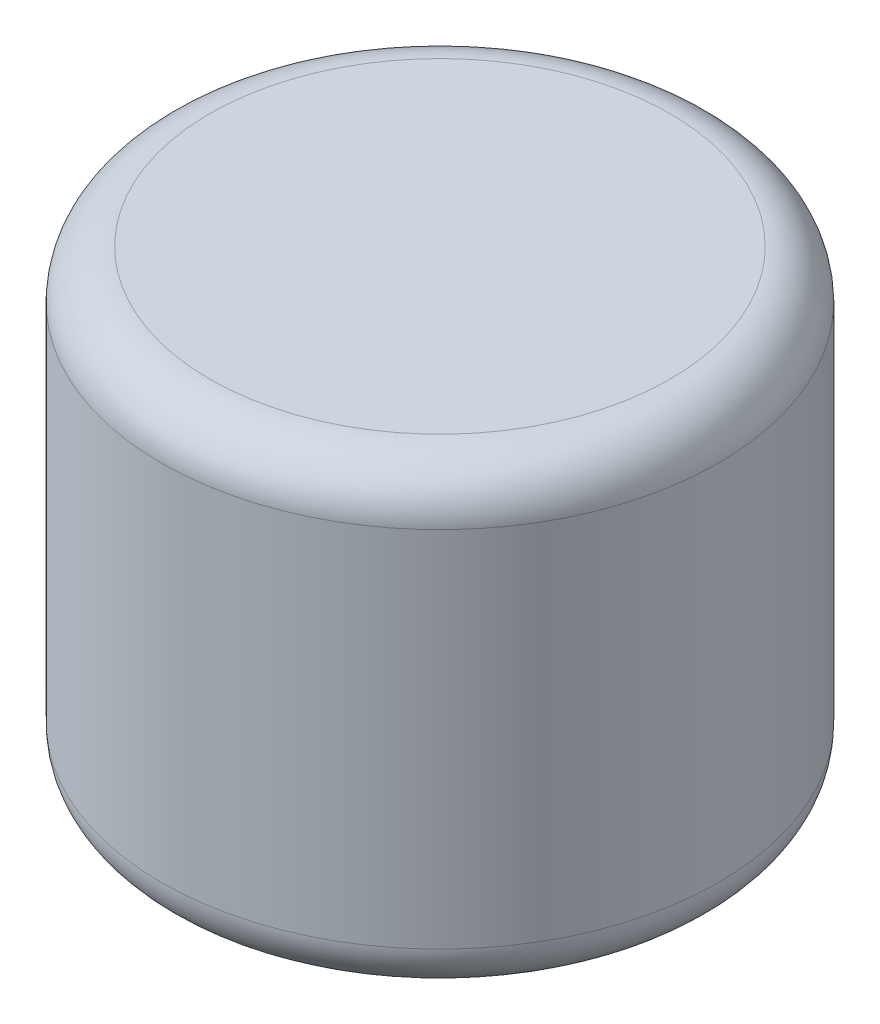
from build123d import *

# Parameters (mm, degrees)
SKETCH1_R           = 11.5
BOSS_EXTRUDE1_DEPTH = 19
FILLET1_R           = 2


with BuildPart() as part:
    # Sketch1 → Boss-Extrude1 (new body)
    with BuildSketch(Plane(origin=(0, 0, 0), x_dir=(1, 0, 0), z_dir=(0, 1, 0))):
        with Locations(Location((0, 0, 0), (0, 0, 270))):
            Circle(SKETCH1_R)
    extrude(amount=BOSS_EXTRUDE1_DEPTH)

    # Fillet1
    fillet1_edges = [part.edges().sort_by_distance(p)[0] for p in [
        (0, 0, -11.5),
        (0, 19, -11.5),
    ]]
    fillet(fillet1_edges, radius=FILLET1_R)


solid = part.part
